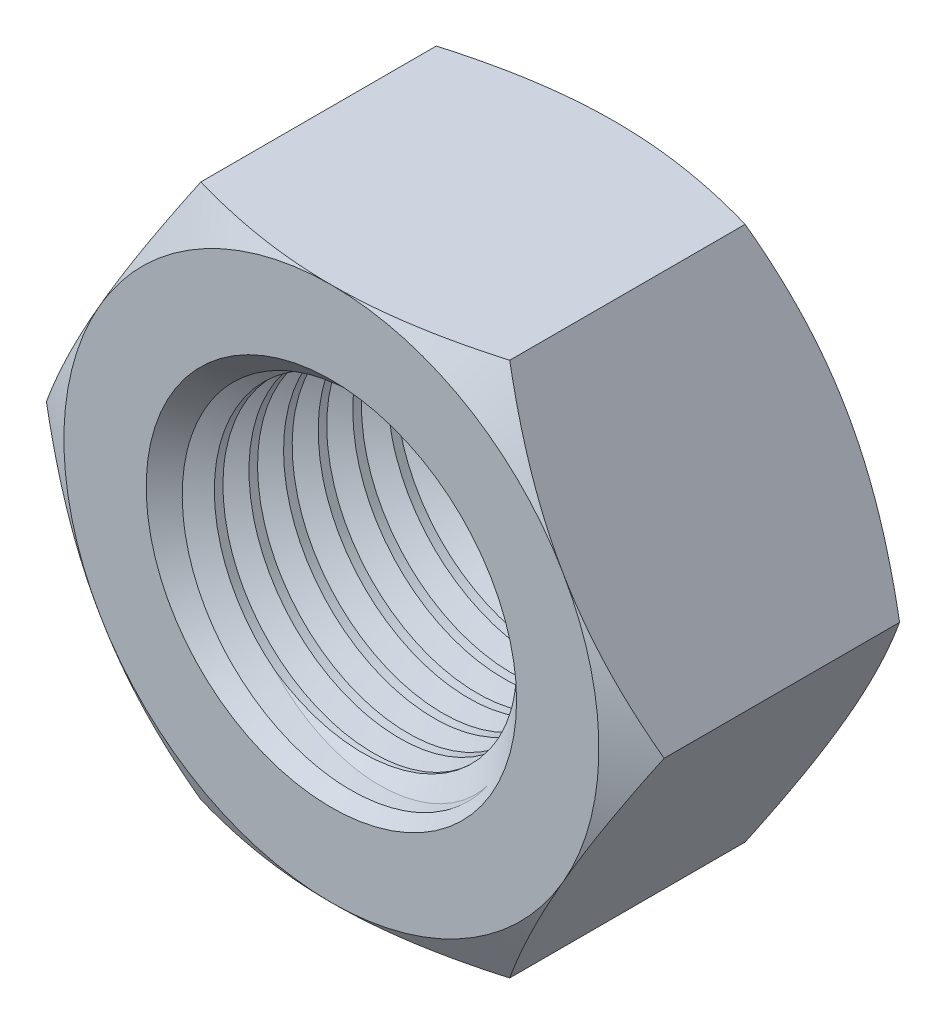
from build123d import *

# Parameters (mm, degrees)
Y_KSEKLIK_EKSTR_ZYON1_DEPTH = 45
IZIM2_OUTSIDE_W             = 283.518
IZIM2_OUTSIDE_H             = 270.368
IZIM2_OUTSIDE_R             = 42.5
KES_EKSTR_ZYON1_DEPTH       = 45
KES_EKSTR_ZYON1_DRAFT       = -60
IZIM3_OUTSIDE_W             = 283.518
IZIM3_OUTSIDE_H             = 270.368
IZIM3_OUTSIDE_R             = 42.5
KES_EKSTR_ZYON2_DEPTH       = 45
KES_EKSTR_ZYON2_DRAFT       = -60
IZIM4_R                     = 24.425
KES_EKSTR_ZYON3_DEPTH       = 45
PAH1_SIZE                   = 5
KES_S_P_R1_PITCH            = 5.5
KES_S_P_R1_HEIGHT           = 50
KES_S_P_R1_RADIUS           = 24.425


with BuildPart() as part:
    # izim1 → Y_kseklik-Ekstr_zyon1 (new body)
    with BuildSketch(Plane.XY):
        Polygon((49.074772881, 0), (24.537386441, 42.5), (-24.537386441, 42.5), (-49.074772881, 0), (-24.537386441, -42.5), (24.537386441, -42.5), align=None)
    extrude(amount=Y_KSEKLIK_EKSTR_ZYON1_DEPTH)


with BuildPart() as kes_ekstr_zyon1_tool:
    # izim2 outside → Kes-Ekstr_zyon1 (with draft: the straight prism first)
    with BuildSketch(Plane.XY.offset(45)):
        Rectangle(IZIM2_OUTSIDE_W, IZIM2_OUTSIDE_H)
        Circle(IZIM2_OUTSIDE_R, mode=Mode.SUBTRACT)
    extrude(amount=-KES_EKSTR_ZYON1_DEPTH)
    # Kes-Ekstr_zyon1: the draft: its side faces are tilted about the plane it starts from
    kes_ekstr_zyon1_sides = [kes_ekstr_zyon1_tool.faces().sort_by_distance(p)[0] for p in [
        (0, -135.184, 22.5),
        (141.759, 0, 22.5),
        (0, 135.184, 22.5),
        (-141.759, 0, 22.5),
        (-42.5, 0, 22.5),
    ]]
    draft(kes_ekstr_zyon1_sides, Plane.XY.offset(45), KES_EKSTR_ZYON1_DRAFT)


with BuildPart() as part_1:
    add(part.part)

    # Kes-Ekstr_zyon1: cut by kes_ekstr_zyon1_tool
    add(kes_ekstr_zyon1_tool.part, mode=Mode.SUBTRACT)


with BuildPart() as kes_ekstr_zyon2_tool:
    # izim3 outside → Kes-Ekstr_zyon2 (with draft: the straight prism first)
    with BuildSketch(Plane(origin=(0, 0, 0), x_dir=(-1, 0, 0), z_dir=(0, 0, -1))):
        Rectangle(IZIM3_OUTSIDE_W, IZIM3_OUTSIDE_H)
        Circle(IZIM3_OUTSIDE_R, mode=Mode.SUBTRACT)
    extrude(amount=-KES_EKSTR_ZYON2_DEPTH)
    # Kes-Ekstr_zyon2: the draft: its side faces are tilted about the plane it starts from
    kes_ekstr_zyon2_sides = [kes_ekstr_zyon2_tool.faces().sort_by_distance(p)[0] for p in [
        (0, -135.184, 22.5),
        (-141.759, 0, 22.5),
        (0, 135.184, 22.5),
        (141.759, 0, 22.5),
        (42.5, 0, 22.5),
    ]]
    draft(kes_ekstr_zyon2_sides, Plane(origin=(0, 0, 0), x_dir=(-1, 0, 0), z_dir=(0, 0, -1)), KES_EKSTR_ZYON2_DRAFT)


with BuildPart() as part_2:
    add(part_1.part)

    # Kes-Ekstr_zyon2: cut by kes_ekstr_zyon2_tool
    add(kes_ekstr_zyon2_tool.part, mode=Mode.SUBTRACT)

    # izim4 → Kes-Ekstr_zyon3 (cut)
    with BuildSketch(Plane.XY.offset(45)):
        Circle(IZIM4_R)
    extrude(amount=-KES_EKSTR_ZYON3_DEPTH, mode=Mode.SUBTRACT)

    # Pah1
    pah1_edges = [part_2.edges().sort_by_distance(p)[0] for p in [
        (-24.425, 0, 0),
        (-24.425, 0, 45),
    ]]
    chamfer(pah1_edges, length=PAH1_SIZE)

    # Kes-S_p_r1: sweep along a helix
    with BuildLine() as kes_s_p_r1_path:
        Helix(KES_S_P_R1_PITCH, KES_S_P_R1_HEIGHT, KES_S_P_R1_RADIUS, center=(0, 0, 0), direction=(0, 0, 1))
    # izim6 → Kes-S_p_r1 (sweep, cut)
    with BuildSketch(Plane(origin=(20.547617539, 13.205151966, 50), x_dir=(0.8414763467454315, 0.5398043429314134, 0.022996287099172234), z_dir=(-0.5402939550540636, 0.8407138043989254, 0.03581537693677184))):
        Polygon((-1.253161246, 2.787540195), (-1.253161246, -2.787540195), (3.575, 0), align=None)
    sweep(path=kes_s_p_r1_path.line, is_frenet=True, mode=Mode.SUBTRACT)


solid = part_2.part
